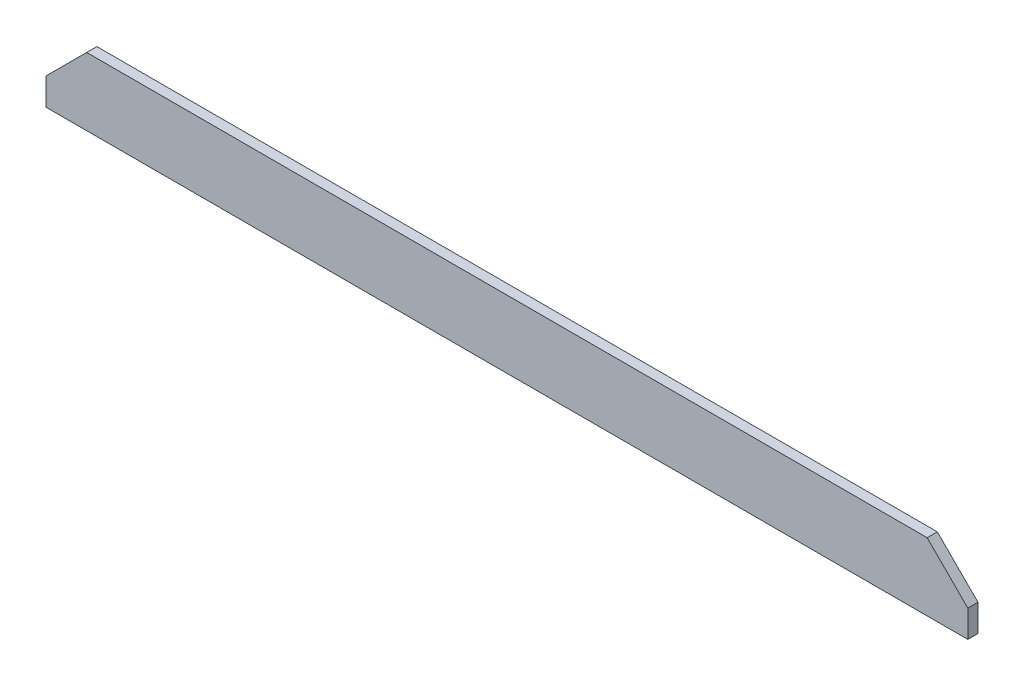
ISO-10303-21;
HEADER;
FILE_DESCRIPTION(('STEP AP214'),'2;1');
FILE_NAME('part.step','',(''),(''),'','','');
FILE_SCHEMA(('AUTOMOTIVE_DESIGN { 1 0 10303 214 1 1 1 1 }'));
ENDSEC;
DATA;
#1=APPLICATION_CONTEXT('core data for automotive mechanical design processes');
#2=APPLICATION_PROTOCOL_DEFINITION('international standard','automotive_design',2000,#1);
#3=PRODUCT_CONTEXT('',#1,'mechanical');
#4=PRODUCT('Part','Part','',(#3));
#5=PRODUCT_RELATED_PRODUCT_CATEGORY('part','',(#4));
#6=PRODUCT_DEFINITION_FORMATION('','',#4);
#7=PRODUCT_DEFINITION_CONTEXT('part definition',#1,'design');
#8=PRODUCT_DEFINITION('design','',#6,#7);
#9=PRODUCT_DEFINITION_SHAPE('','',#8);
#10=(LENGTH_UNIT() NAMED_UNIT(*) SI_UNIT(.MILLI.,.METRE.));
#11=(NAMED_UNIT(*) PLANE_ANGLE_UNIT() SI_UNIT($,.RADIAN.));
#12=(NAMED_UNIT(*) SI_UNIT($,.STERADIAN.) SOLID_ANGLE_UNIT());
#13=UNCERTAINTY_MEASURE_WITH_UNIT(LENGTH_MEASURE(1.E-05),#10,'distance_accuracy_value','');
#14=(GEOMETRIC_REPRESENTATION_CONTEXT(3) GLOBAL_UNCERTAINTY_ASSIGNED_CONTEXT((#13)) GLOBAL_UNIT_ASSIGNED_CONTEXT((#10,
#11,#12)) REPRESENTATION_CONTEXT('',''));
#15=CARTESIAN_POINT('',(0.,0.,0.));
#16=DIRECTION('',(0.,0.,1.));
#17=DIRECTION('',(1.,0.,0.));
#18=AXIS2_PLACEMENT_3D('',#15,#16,#17);
#19=CARTESIAN_POINT('',(0.,0.,-9.525));
#20=DIRECTION('',(-1.,0.,0.));
#21=DIRECTION('',(0.,-1.,0.));
#22=AXIS2_PLACEMENT_3D('',#19,#20,#21);
#23=PLANE('',#22);
#24=DIRECTION('',(0.,-1.,0.));
#25=VECTOR('',#24,1.);
#26=CARTESIAN_POINT('',(0.,0.,0.));
#27=LINE('',#26,#25);
#28=CARTESIAN_POINT('',(0.,-38.1000000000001,0.));
#29=VERTEX_POINT('',#28);
#30=CARTESIAN_POINT('',(0.,-63.5,0.));
#31=VERTEX_POINT('',#30);
#32=EDGE_CURVE('E76',#29,#31,#27,.T.);
#33=ORIENTED_EDGE('',*,*,#32,.F.);
#34=DIRECTION('',(0.,0.,-1.));
#35=VECTOR('',#34,1.);
#36=CARTESIAN_POINT('',(0.,-38.1000000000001,-9.525));
#37=LINE('',#36,#35);
#38=CARTESIAN_POINT('',(0.,-38.1000000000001,-9.525));
#39=VERTEX_POINT('',#38);
#40=EDGE_CURVE('E116',#29,#39,#37,.T.);
#41=ORIENTED_EDGE('',*,*,#40,.T.);
#42=DIRECTION('',(0.,-1.,0.));
#43=VECTOR('',#42,1.);
#44=CARTESIAN_POINT('',(0.,0.,-9.525));
#45=LINE('',#44,#43);
#46=CARTESIAN_POINT('',(0.,-63.5,-9.525));
#47=VERTEX_POINT('',#46);
#48=EDGE_CURVE('E89',#39,#47,#45,.T.);
#49=ORIENTED_EDGE('',*,*,#48,.T.);
#50=DIRECTION('',(0.,0.,1.));
#51=VECTOR('',#50,1.);
#52=CARTESIAN_POINT('',(0.,-63.5,-9.525));
#53=LINE('',#52,#51);
#54=EDGE_CURVE('E87',#47,#31,#53,.T.);
#55=ORIENTED_EDGE('',*,*,#54,.T.);
#56=EDGE_LOOP('',(#33,#41,#49,#55));
#57=FACE_BOUND('',#56,.T.);
#58=ADVANCED_FACE('F27',(#57),#23,.T.);
#59=CARTESIAN_POINT('',(0.,0.,-9.525));
#60=DIRECTION('',(0.,1.,0.));
#61=DIRECTION('',(0.,0.,1.));
#62=AXIS2_PLACEMENT_3D('',#59,#60,#61);
#63=PLANE('',#62);
#64=DIRECTION('',(-1.,0.,0.));
#65=VECTOR('',#64,1.);
#66=CARTESIAN_POINT('',(0.,0.,0.));
#67=LINE('',#66,#65);
#68=CARTESIAN_POINT('',(825.5,0.,0.));
#69=VERTEX_POINT('',#68);
#70=CARTESIAN_POINT('',(38.1,0.,0.));
#71=VERTEX_POINT('',#70);
#72=EDGE_CURVE('E100',#69,#71,#67,.T.);
#73=ORIENTED_EDGE('',*,*,#72,.F.);
#74=DIRECTION('',(0.,0.,-1.));
#75=VECTOR('',#74,1.);
#76=CARTESIAN_POINT('',(825.5,0.,-9.525));
#77=LINE('',#76,#75);
#78=CARTESIAN_POINT('',(825.5,0.,-9.525));
#79=VERTEX_POINT('',#78);
#80=EDGE_CURVE('E34',#69,#79,#77,.T.);
#81=ORIENTED_EDGE('',*,*,#80,.T.);
#82=DIRECTION('',(-1.,0.,0.));
#83=VECTOR('',#82,1.);
#84=CARTESIAN_POINT('',(0.,0.,-9.525));
#85=LINE('',#84,#83);
#86=CARTESIAN_POINT('',(38.1,0.,-9.525));
#87=VERTEX_POINT('',#86);
#88=EDGE_CURVE('E94',#79,#87,#85,.T.);
#89=ORIENTED_EDGE('',*,*,#88,.T.);
#90=DIRECTION('',(0.,0.,1.));
#91=VECTOR('',#90,1.);
#92=CARTESIAN_POINT('',(38.1,0.,-9.525));
#93=LINE('',#92,#91);
#94=EDGE_CURVE('E111',#87,#71,#93,.T.);
#95=ORIENTED_EDGE('',*,*,#94,.T.);
#96=EDGE_LOOP('',(#73,#81,#89,#95));
#97=FACE_BOUND('',#96,.T.);
#98=ADVANCED_FACE('F135',(#97),#63,.T.);
#99=CARTESIAN_POINT('',(863.6,0.,-9.525));
#100=DIRECTION('',(1.,0.,0.));
#101=DIRECTION('',(0.,0.,-1.));
#102=AXIS2_PLACEMENT_3D('',#99,#100,#101);
#103=PLANE('',#102);
#104=DIRECTION('',(0.,1.,0.));
#105=VECTOR('',#104,1.);
#106=CARTESIAN_POINT('',(863.6,0.,-9.525));
#107=LINE('',#106,#105);
#108=CARTESIAN_POINT('',(863.6,-63.5,-9.525));
#109=VERTEX_POINT('',#108);
#110=CARTESIAN_POINT('',(863.6,-38.1,-9.525));
#111=VERTEX_POINT('',#110);
#112=EDGE_CURVE('E107',#109,#111,#107,.T.);
#113=ORIENTED_EDGE('',*,*,#112,.T.);
#114=DIRECTION('',(0.,0.,1.));
#115=VECTOR('',#114,1.);
#116=CARTESIAN_POINT('',(863.6,-38.1,-9.525));
#117=LINE('',#116,#115);
#118=CARTESIAN_POINT('',(863.6,-38.1000000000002,0.));
#119=VERTEX_POINT('',#118);
#120=EDGE_CURVE('E121',#111,#119,#117,.T.);
#121=ORIENTED_EDGE('',*,*,#120,.T.);
#122=DIRECTION('',(0.,1.,0.));
#123=VECTOR('',#122,1.);
#124=CARTESIAN_POINT('',(863.6,0.,0.));
#125=LINE('',#124,#123);
#126=CARTESIAN_POINT('',(863.6,-63.5,0.));
#127=VERTEX_POINT('',#126);
#128=EDGE_CURVE('E98',#127,#119,#125,.T.);
#129=ORIENTED_EDGE('',*,*,#128,.F.);
#130=DIRECTION('',(0.,0.,1.));
#131=VECTOR('',#130,1.);
#132=CARTESIAN_POINT('',(863.6,-63.5,-9.525));
#133=LINE('',#132,#131);
#134=EDGE_CURVE('E93',#109,#127,#133,.T.);
#135=ORIENTED_EDGE('',*,*,#134,.F.);
#136=EDGE_LOOP('',(#113,#121,#129,#135));
#137=FACE_BOUND('',#136,.T.);
#138=ADVANCED_FACE('F126',(#137),#103,.T.);
#139=CARTESIAN_POINT('',(0.,-63.5,-9.525));
#140=DIRECTION('',(0.,-1.,0.));
#141=DIRECTION('',(0.,0.,-1.));
#142=AXIS2_PLACEMENT_3D('',#139,#140,#141);
#143=PLANE('',#142);
#144=DIRECTION('',(1.,0.,0.));
#145=VECTOR('',#144,1.);
#146=CARTESIAN_POINT('',(0.,-63.5,0.));
#147=LINE('',#146,#145);
#148=EDGE_CURVE('E80',#31,#127,#147,.T.);
#149=ORIENTED_EDGE('',*,*,#148,.F.);
#150=ORIENTED_EDGE('',*,*,#54,.F.);
#151=DIRECTION('',(1.,0.,0.));
#152=VECTOR('',#151,1.);
#153=CARTESIAN_POINT('',(0.,-63.5,-9.525));
#154=LINE('',#153,#152);
#155=EDGE_CURVE('E105',#47,#109,#154,.T.);
#156=ORIENTED_EDGE('',*,*,#155,.T.);
#157=ORIENTED_EDGE('',*,*,#134,.T.);
#158=EDGE_LOOP('',(#149,#150,#156,#157));
#159=FACE_BOUND('',#158,.T.);
#160=ADVANCED_FACE('F96',(#159),#143,.T.);
#161=CARTESIAN_POINT('',(0.,-63.5,-9.525));
#162=DIRECTION('',(0.,0.,1.));
#163=DIRECTION('',(1.,0.,0.));
#164=AXIS2_PLACEMENT_3D('',#161,#162,#163);
#165=PLANE('',#164);
#166=ORIENTED_EDGE('',*,*,#88,.F.);
#167=DIRECTION('',(-0.707106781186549,0.707106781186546,0.));
#168=VECTOR('',#167,1.);
#169=CARTESIAN_POINT('',(863.6,-38.1,-9.525));
#170=LINE('',#169,#168);
#171=EDGE_CURVE('E11',#79,#111,#170,.F.);
#172=ORIENTED_EDGE('',*,*,#171,.T.);
#173=ORIENTED_EDGE('',*,*,#112,.F.);
#174=ORIENTED_EDGE('',*,*,#155,.F.);
#175=ORIENTED_EDGE('',*,*,#48,.F.);
#176=DIRECTION('',(-0.707106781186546,-0.707106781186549,0.));
#177=VECTOR('',#176,1.);
#178=CARTESIAN_POINT('',(38.1,0.,-9.525));
#179=LINE('',#178,#177);
#180=EDGE_CURVE('E118',#39,#87,#179,.F.);
#181=ORIENTED_EDGE('',*,*,#180,.T.);
#182=EDGE_LOOP('',(#166,#172,#173,#174,#175,#181));
#183=FACE_BOUND('',#182,.T.);
#184=ADVANCED_FACE('F132',(#183),#165,.F.);
#185=CARTESIAN_POINT('',(0.,-63.5,0.));
#186=DIRECTION('',(0.,0.,1.));
#187=DIRECTION('',(1.,0.,0.));
#188=AXIS2_PLACEMENT_3D('',#185,#186,#187);
#189=PLANE('',#188);
#190=ORIENTED_EDGE('',*,*,#128,.T.);
#191=DIRECTION('',(0.707106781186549,-0.707106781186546,0.));
#192=VECTOR('',#191,1.);
#193=CARTESIAN_POINT('',(444.499999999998,381.,0.));
#194=LINE('',#193,#192);
#195=EDGE_CURVE('E48',#119,#69,#194,.F.);
#196=ORIENTED_EDGE('',*,*,#195,.T.);
#197=ORIENTED_EDGE('',*,*,#72,.T.);
#198=DIRECTION('',(0.707106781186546,0.707106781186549,0.));
#199=VECTOR('',#198,1.);
#200=CARTESIAN_POINT('',(-12.6999999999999,-50.8000000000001,0.));
#201=LINE('',#200,#199);
#202=EDGE_CURVE('E82',#71,#29,#201,.F.);
#203=ORIENTED_EDGE('',*,*,#202,.T.);
#204=ORIENTED_EDGE('',*,*,#32,.T.);
#205=ORIENTED_EDGE('',*,*,#148,.T.);
#206=EDGE_LOOP('',(#190,#196,#197,#203,#204,#205));
#207=FACE_BOUND('',#206,.T.);
#208=ADVANCED_FACE('F78',(#207),#189,.T.);
#209=CARTESIAN_POINT('',(38.1,0.,-9.525));
#210=DIRECTION('',(0.707106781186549,-0.707106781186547,0.));
#211=DIRECTION('',(0.707106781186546,0.707106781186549,0.));
#212=AXIS2_PLACEMENT_3D('',#209,#210,#211);
#213=PLANE('',#212);
#214=ORIENTED_EDGE('',*,*,#180,.F.);
#215=ORIENTED_EDGE('',*,*,#40,.F.);
#216=ORIENTED_EDGE('',*,*,#202,.F.);
#217=ORIENTED_EDGE('',*,*,#94,.F.);
#218=EDGE_LOOP('',(#214,#215,#216,#217));
#219=FACE_BOUND('',#218,.T.);
#220=ADVANCED_FACE('F137',(#219),#213,.F.);
#221=CARTESIAN_POINT('',(863.6,-38.1,-9.525));
#222=DIRECTION('',(-0.707106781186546,-0.707106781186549,0.));
#223=DIRECTION('',(0.707106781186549,-0.707106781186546,0.));
#224=AXIS2_PLACEMENT_3D('',#221,#222,#223);
#225=PLANE('',#224);
#226=ORIENTED_EDGE('',*,*,#171,.F.);
#227=ORIENTED_EDGE('',*,*,#80,.F.);
#228=ORIENTED_EDGE('',*,*,#195,.F.);
#229=ORIENTED_EDGE('',*,*,#120,.F.);
#230=EDGE_LOOP('',(#226,#227,#228,#229));
#231=FACE_BOUND('',#230,.T.);
#232=ADVANCED_FACE('F130',(#231),#225,.F.);
#233=CLOSED_SHELL('',(#58,#98,#138,#160,#184,#208,#220,#232));
#234=MANIFOLD_SOLID_BREP('B2',#233);
#235=ADVANCED_BREP_SHAPE_REPRESENTATION('',(#18,#234),#14);
#236=SHAPE_DEFINITION_REPRESENTATION(#9,#235);
ENDSEC;
END-ISO-10303-21;
